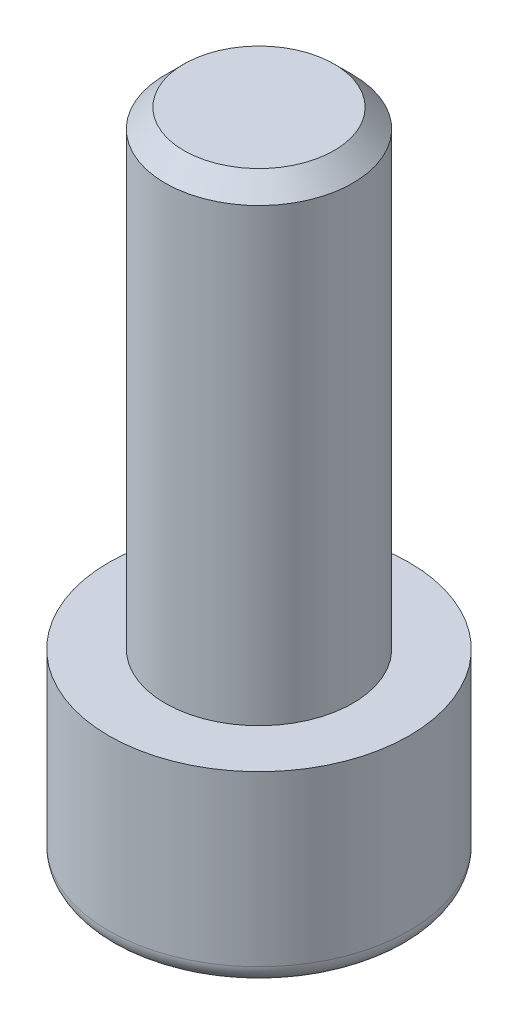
ISO-10303-21;
HEADER;
FILE_DESCRIPTION(('STEP AP214'),'2;1');
FILE_NAME('part.step','',(''),(''),'','','');
FILE_SCHEMA(('AUTOMOTIVE_DESIGN { 1 0 10303 214 1 1 1 1 }'));
ENDSEC;
DATA;
#1=APPLICATION_CONTEXT('core data for automotive mechanical design processes');
#2=APPLICATION_PROTOCOL_DEFINITION('international standard','automotive_design',2000,#1);
#3=PRODUCT_CONTEXT('',#1,'mechanical');
#4=PRODUCT('Part','Part','',(#3));
#5=PRODUCT_RELATED_PRODUCT_CATEGORY('part','',(#4));
#6=PRODUCT_DEFINITION_FORMATION('','',#4);
#7=PRODUCT_DEFINITION_CONTEXT('part definition',#1,'design');
#8=PRODUCT_DEFINITION('design','',#6,#7);
#9=PRODUCT_DEFINITION_SHAPE('','',#8);
#10=(LENGTH_UNIT() NAMED_UNIT(*) SI_UNIT(.MILLI.,.METRE.));
#11=(NAMED_UNIT(*) PLANE_ANGLE_UNIT() SI_UNIT($,.RADIAN.));
#12=(NAMED_UNIT(*) SI_UNIT($,.STERADIAN.) SOLID_ANGLE_UNIT());
#13=UNCERTAINTY_MEASURE_WITH_UNIT(LENGTH_MEASURE(1.E-05),#10,'distance_accuracy_value','');
#14=(GEOMETRIC_REPRESENTATION_CONTEXT(3) GLOBAL_UNCERTAINTY_ASSIGNED_CONTEXT((#13)) GLOBAL_UNIT_ASSIGNED_CONTEXT((#10,
#11,#12)) REPRESENTATION_CONTEXT('',''));
#15=CARTESIAN_POINT('',(0.,0.,0.));
#16=DIRECTION('',(0.,0.,1.));
#17=DIRECTION('',(1.,0.,0.));
#18=AXIS2_PLACEMENT_3D('',#15,#16,#17);
#19=CARTESIAN_POINT('',(0.,25.,0.));
#20=DIRECTION('',(0.,-1.,0.));
#21=DIRECTION('',(0.,0.,-1.));
#22=AXIS2_PLACEMENT_3D('',#19,#20,#21);
#23=CYLINDRICAL_SURFACE('',#22,5.);
#24=CARTESIAN_POINT('',(0.,24.,0.));
#25=DIRECTION('',(0.,1.,0.));
#26=DIRECTION('',(0.,0.,1.));
#27=AXIS2_PLACEMENT_3D('',#24,#25,#26);
#28=CIRCLE('',#27,5.);
#29=CARTESIAN_POINT('',(0.,24.,5.));
#30=VERTEX_POINT('',#29);
#31=EDGE_CURVE('E147',#30,#30,#28,.F.);
#32=ORIENTED_EDGE('',*,*,#31,.T.);
#33=EDGE_LOOP('',(#32));
#34=FACE_BOUND('',#33,.T.);
#35=CARTESIAN_POINT('',(0.,0.,0.));
#36=DIRECTION('',(0.,-1.,0.));
#37=DIRECTION('',(0.,0.,-1.));
#38=AXIS2_PLACEMENT_3D('',#35,#36,#37);
#39=CIRCLE('',#38,5.);
#40=CARTESIAN_POINT('',(0.,0.,-5.));
#41=VERTEX_POINT('',#40);
#42=EDGE_CURVE('E141',#41,#41,#39,.T.);
#43=ORIENTED_EDGE('',*,*,#42,.F.);
#44=EDGE_LOOP('',(#43));
#45=FACE_BOUND('',#44,.T.);
#46=ADVANCED_FACE('F30',(#34,#45),#23,.T.);
#47=CARTESIAN_POINT('',(0.,25.,0.));
#48=DIRECTION('',(0.,1.,0.));
#49=DIRECTION('',(0.,0.,1.));
#50=AXIS2_PLACEMENT_3D('',#47,#48,#49);
#51=PLANE('',#50);
#52=CARTESIAN_POINT('',(0.,25.,0.));
#53=DIRECTION('',(0.,1.,0.));
#54=DIRECTION('',(0.,0.,1.));
#55=AXIS2_PLACEMENT_3D('',#52,#53,#54);
#56=CIRCLE('',#55,4.);
#57=CARTESIAN_POINT('',(0.,25.,4.));
#58=VERTEX_POINT('',#57);
#59=EDGE_CURVE('E144',#58,#58,#56,.T.);
#60=ORIENTED_EDGE('',*,*,#59,.T.);
#61=EDGE_LOOP('',(#60));
#62=FACE_BOUND('',#61,.T.);
#63=ADVANCED_FACE('F168',(#62),#51,.T.);
#64=CARTESIAN_POINT('',(0.,25.,0.));
#65=DIRECTION('',(0.,-1.,0.));
#66=DIRECTION('',(0.,0.,-1.));
#67=AXIS2_PLACEMENT_3D('',#64,#65,#66);
#68=CONICAL_SURFACE('',#67,4.,0.785398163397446);
#69=ORIENTED_EDGE('',*,*,#31,.F.);
#70=EDGE_LOOP('',(#69));
#71=FACE_BOUND('',#70,.T.);
#72=ORIENTED_EDGE('',*,*,#59,.F.);
#73=EDGE_LOOP('',(#72));
#74=FACE_BOUND('',#73,.T.);
#75=ADVANCED_FACE('F173',(#71,#74),#68,.T.);
#76=CARTESIAN_POINT('',(0.,0.,0.));
#77=DIRECTION('',(0.,-1.,0.));
#78=DIRECTION('',(0.,0.,-1.));
#79=AXIS2_PLACEMENT_3D('',#76,#77,#78);
#80=PLANE('',#79);
#81=CARTESIAN_POINT('',(0.,0.,0.));
#82=DIRECTION('',(0.,-1.,0.));
#83=DIRECTION('',(0.,0.,-1.));
#84=AXIS2_PLACEMENT_3D('',#81,#82,#83);
#85=CIRCLE('',#84,8.);
#86=CARTESIAN_POINT('',(0.,0.,-8.));
#87=VERTEX_POINT('',#86);
#88=EDGE_CURVE('E132',#87,#87,#85,.T.);
#89=ORIENTED_EDGE('',*,*,#88,.F.);
#90=EDGE_LOOP('',(#89));
#91=FACE_BOUND('',#90,.T.);
#92=ORIENTED_EDGE('',*,*,#42,.T.);
#93=EDGE_LOOP('',(#92));
#94=FACE_BOUND('',#93,.T.);
#95=ADVANCED_FACE('F179',(#91,#94),#80,.F.);
#96=CARTESIAN_POINT('',(0.,-10.,0.));
#97=DIRECTION('',(0.,1.,0.));
#98=DIRECTION('',(0.,0.,1.));
#99=AXIS2_PLACEMENT_3D('',#96,#97,#98);
#100=CYLINDRICAL_SURFACE('',#99,8.);
#101=CARTESIAN_POINT('',(0.,-9.,0.));
#102=DIRECTION('',(0.,-1.,0.));
#103=DIRECTION('',(0.,0.,-1.));
#104=AXIS2_PLACEMENT_3D('',#101,#102,#103);
#105=CIRCLE('',#104,8.);
#106=CARTESIAN_POINT('',(0.,-9.,-8.));
#107=VERTEX_POINT('',#106);
#108=EDGE_CURVE('E11',#107,#107,#105,.F.);
#109=ORIENTED_EDGE('',*,*,#108,.T.);
#110=EDGE_LOOP('',(#109));
#111=FACE_BOUND('',#110,.T.);
#112=ORIENTED_EDGE('',*,*,#88,.T.);
#113=EDGE_LOOP('',(#112));
#114=FACE_BOUND('',#113,.T.);
#115=ADVANCED_FACE('F163',(#111,#114),#100,.T.);
#116=CARTESIAN_POINT('',(0.,-10.,0.));
#117=DIRECTION('',(0.,-1.,0.));
#118=DIRECTION('',(0.,0.,-1.));
#119=AXIS2_PLACEMENT_3D('',#116,#117,#118);
#120=PLANE('',#119);
#121=DIRECTION('',(-0.867435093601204,0.,0.497550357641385));
#122=VECTOR('',#121,1.);
#123=CARTESIAN_POINT('',(0.,-10.,4.6));
#124=LINE('',#123,#122);
#125=CARTESIAN_POINT('',(4.,-10.,2.30564801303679));
#126=VERTEX_POINT('',#125);
#127=CARTESIAN_POINT('',(0.,-10.,4.6));
#128=VERTEX_POINT('',#127);
#129=EDGE_CURVE('E44',#126,#128,#124,.T.);
#130=ORIENTED_EDGE('',*,*,#129,.F.);
#131=DIRECTION('',(0.,0.,1.));
#132=VECTOR('',#131,1.);
#133=CARTESIAN_POINT('',(4.,-10.,2.30564801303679));
#134=LINE('',#133,#132);
#135=CARTESIAN_POINT('',(4.,-10.,-2.30564801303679));
#136=VERTEX_POINT('',#135);
#137=EDGE_CURVE('E114',#136,#126,#134,.T.);
#138=ORIENTED_EDGE('',*,*,#137,.F.);
#139=DIRECTION('',(0.867435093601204,0.,0.497550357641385));
#140=VECTOR('',#139,1.);
#141=CARTESIAN_POINT('',(4.,-10.,-2.30564801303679));
#142=LINE('',#141,#140);
#143=CARTESIAN_POINT('',(0.,-10.,-4.6));
#144=VERTEX_POINT('',#143);
#145=EDGE_CURVE('E108',#144,#136,#142,.T.);
#146=ORIENTED_EDGE('',*,*,#145,.F.);
#147=DIRECTION('',(0.867435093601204,0.,-0.497550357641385));
#148=VECTOR('',#147,1.);
#149=CARTESIAN_POINT('',(0.,-10.,-4.6));
#150=LINE('',#149,#148);
#151=CARTESIAN_POINT('',(-4.,-10.,-2.30564801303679));
#152=VERTEX_POINT('',#151);
#153=EDGE_CURVE('E106',#152,#144,#150,.T.);
#154=ORIENTED_EDGE('',*,*,#153,.F.);
#155=DIRECTION('',(0.,0.,-1.));
#156=VECTOR('',#155,1.);
#157=CARTESIAN_POINT('',(-4.,-10.,-2.30564801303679));
#158=LINE('',#157,#156);
#159=CARTESIAN_POINT('',(-4.,-10.,2.30564801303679));
#160=VERTEX_POINT('',#159);
#161=EDGE_CURVE('E87',#160,#152,#158,.T.);
#162=ORIENTED_EDGE('',*,*,#161,.F.);
#163=DIRECTION('',(-0.867435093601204,0.,-0.497550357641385));
#164=VECTOR('',#163,1.);
#165=CARTESIAN_POINT('',(-4.,-10.,2.30564801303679));
#166=LINE('',#165,#164);
#167=EDGE_CURVE('E98',#128,#160,#166,.T.);
#168=ORIENTED_EDGE('',*,*,#167,.F.);
#169=EDGE_LOOP('',(#130,#138,#146,#154,#162,#168));
#170=FACE_BOUND('',#169,.T.);
#171=CARTESIAN_POINT('',(0.,-10.,0.));
#172=DIRECTION('',(0.,-1.,0.));
#173=DIRECTION('',(0.,0.,-1.));
#174=AXIS2_PLACEMENT_3D('',#171,#172,#173);
#175=CIRCLE('',#174,7.);
#176=CARTESIAN_POINT('',(0.,-10.,-7.));
#177=VERTEX_POINT('',#176);
#178=EDGE_CURVE('E37',#177,#177,#175,.T.);
#179=ORIENTED_EDGE('',*,*,#178,.T.);
#180=EDGE_LOOP('',(#179));
#181=FACE_BOUND('',#180,.T.);
#182=ADVANCED_FACE('F102',(#170,#181),#120,.T.);
#183=CARTESIAN_POINT('',(0.,-9.,0.));
#184=DIRECTION('',(0.,-1.,0.));
#185=DIRECTION('',(0.,0.,-1.));
#186=AXIS2_PLACEMENT_3D('',#183,#184,#185);
#187=TOROIDAL_SURFACE('',#186,7.,1.);
#188=ORIENTED_EDGE('',*,*,#108,.F.);
#189=EDGE_LOOP('',(#188));
#190=FACE_BOUND('',#189,.T.);
#191=ORIENTED_EDGE('',*,*,#178,.F.);
#192=EDGE_LOOP('',(#191));
#193=FACE_BOUND('',#192,.T.);
#194=ADVANCED_FACE('F152',(#190,#193),#187,.T.);
#195=CARTESIAN_POINT('',(0.,-4.,4.6));
#196=DIRECTION('',(0.497550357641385,0.,0.867435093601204));
#197=DIRECTION('',(0.867435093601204,0.,-0.497550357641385));
#198=AXIS2_PLACEMENT_3D('',#195,#196,#197);
#199=PLANE('',#198);
#200=ORIENTED_EDGE('',*,*,#129,.T.);
#201=DIRECTION('',(0.,-1.,0.));
#202=VECTOR('',#201,1.);
#203=CARTESIAN_POINT('',(0.,-4.,4.6));
#204=LINE('',#203,#202);
#205=CARTESIAN_POINT('',(0.,-4.,4.6));
#206=VERTEX_POINT('',#205);
#207=EDGE_CURVE('E95',#206,#128,#204,.T.);
#208=ORIENTED_EDGE('',*,*,#207,.F.);
#209=DIRECTION('',(-0.867435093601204,0.,0.497550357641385));
#210=VECTOR('',#209,1.);
#211=CARTESIAN_POINT('',(0.,-4.,4.6));
#212=LINE('',#211,#210);
#213=CARTESIAN_POINT('',(4.,-4.,2.30564801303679));
#214=VERTEX_POINT('',#213);
#215=EDGE_CURVE('E116',#214,#206,#212,.T.);
#216=ORIENTED_EDGE('',*,*,#215,.F.);
#217=DIRECTION('',(0.,-1.,0.));
#218=VECTOR('',#217,1.);
#219=CARTESIAN_POINT('',(4.,-4.,2.30564801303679));
#220=LINE('',#219,#218);
#221=EDGE_CURVE('E51',#214,#126,#220,.T.);
#222=ORIENTED_EDGE('',*,*,#221,.T.);
#223=EDGE_LOOP('',(#200,#208,#216,#222));
#224=FACE_BOUND('',#223,.T.);
#225=ADVANCED_FACE('F154',(#224),#199,.F.);
#226=CARTESIAN_POINT('',(4.,-4.,2.30564801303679));
#227=DIRECTION('',(1.,0.,0.));
#228=DIRECTION('',(0.,0.,-1.));
#229=AXIS2_PLACEMENT_3D('',#226,#227,#228);
#230=PLANE('',#229);
#231=ORIENTED_EDGE('',*,*,#137,.T.);
#232=ORIENTED_EDGE('',*,*,#221,.F.);
#233=DIRECTION('',(0.,0.,1.));
#234=VECTOR('',#233,1.);
#235=CARTESIAN_POINT('',(4.,-4.,2.30564801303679));
#236=LINE('',#235,#234);
#237=CARTESIAN_POINT('',(4.,-4.,-2.30564801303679));
#238=VERTEX_POINT('',#237);
#239=EDGE_CURVE('E128',#238,#214,#236,.T.);
#240=ORIENTED_EDGE('',*,*,#239,.F.);
#241=DIRECTION('',(0.,-1.,0.));
#242=VECTOR('',#241,1.);
#243=CARTESIAN_POINT('',(4.,-4.,-2.30564801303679));
#244=LINE('',#243,#242);
#245=EDGE_CURVE('E133',#238,#136,#244,.T.);
#246=ORIENTED_EDGE('',*,*,#245,.T.);
#247=EDGE_LOOP('',(#231,#232,#240,#246));
#248=FACE_BOUND('',#247,.T.);
#249=ADVANCED_FACE('F161',(#248),#230,.F.);
#250=CARTESIAN_POINT('',(4.,-4.,-2.30564801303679));
#251=DIRECTION('',(0.497550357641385,0.,-0.867435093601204));
#252=DIRECTION('',(-0.867435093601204,0.,-0.497550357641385));
#253=AXIS2_PLACEMENT_3D('',#250,#251,#252);
#254=PLANE('',#253);
#255=ORIENTED_EDGE('',*,*,#145,.T.);
#256=ORIENTED_EDGE('',*,*,#245,.F.);
#257=DIRECTION('',(0.867435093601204,0.,0.497550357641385));
#258=VECTOR('',#257,1.);
#259=CARTESIAN_POINT('',(4.,-4.,-2.30564801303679));
#260=LINE('',#259,#258);
#261=CARTESIAN_POINT('',(0.,-4.,-4.6));
#262=VERTEX_POINT('',#261);
#263=EDGE_CURVE('E125',#262,#238,#260,.T.);
#264=ORIENTED_EDGE('',*,*,#263,.F.);
#265=DIRECTION('',(0.,-1.,0.));
#266=VECTOR('',#265,1.);
#267=CARTESIAN_POINT('',(0.,-4.,-4.6));
#268=LINE('',#267,#266);
#269=EDGE_CURVE('E135',#262,#144,#268,.T.);
#270=ORIENTED_EDGE('',*,*,#269,.T.);
#271=EDGE_LOOP('',(#255,#256,#264,#270));
#272=FACE_BOUND('',#271,.T.);
#273=ADVANCED_FACE('F239',(#272),#254,.F.);
#274=CARTESIAN_POINT('',(0.,-4.,-4.6));
#275=DIRECTION('',(-0.497550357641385,0.,-0.867435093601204));
#276=DIRECTION('',(-0.867435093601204,0.,0.497550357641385));
#277=AXIS2_PLACEMENT_3D('',#274,#275,#276);
#278=PLANE('',#277);
#279=ORIENTED_EDGE('',*,*,#153,.T.);
#280=ORIENTED_EDGE('',*,*,#269,.F.);
#281=DIRECTION('',(0.867435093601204,0.,-0.497550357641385));
#282=VECTOR('',#281,1.);
#283=CARTESIAN_POINT('',(0.,-4.,-4.6));
#284=LINE('',#283,#282);
#285=CARTESIAN_POINT('',(-4.,-4.,-2.30564801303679));
#286=VERTEX_POINT('',#285);
#287=EDGE_CURVE('E122',#286,#262,#284,.T.);
#288=ORIENTED_EDGE('',*,*,#287,.F.);
#289=DIRECTION('',(0.,-1.,0.));
#290=VECTOR('',#289,1.);
#291=CARTESIAN_POINT('',(-4.,-4.,-2.30564801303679));
#292=LINE('',#291,#290);
#293=EDGE_CURVE('E94',#286,#152,#292,.T.);
#294=ORIENTED_EDGE('',*,*,#293,.T.);
#295=EDGE_LOOP('',(#279,#280,#288,#294));
#296=FACE_BOUND('',#295,.T.);
#297=ADVANCED_FACE('F247',(#296),#278,.F.);
#298=CARTESIAN_POINT('',(-4.,-4.,-2.30564801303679));
#299=DIRECTION('',(-1.,0.,0.));
#300=DIRECTION('',(0.,0.,1.));
#301=AXIS2_PLACEMENT_3D('',#298,#299,#300);
#302=PLANE('',#301);
#303=ORIENTED_EDGE('',*,*,#161,.T.);
#304=ORIENTED_EDGE('',*,*,#293,.F.);
#305=DIRECTION('',(0.,0.,-1.));
#306=VECTOR('',#305,1.);
#307=CARTESIAN_POINT('',(-4.,-4.,-2.30564801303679));
#308=LINE('',#307,#306);
#309=CARTESIAN_POINT('',(-4.,-4.,2.30564801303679));
#310=VERTEX_POINT('',#309);
#311=EDGE_CURVE('E90',#310,#286,#308,.T.);
#312=ORIENTED_EDGE('',*,*,#311,.F.);
#313=DIRECTION('',(0.,-1.,0.));
#314=VECTOR('',#313,1.);
#315=CARTESIAN_POINT('',(-4.,-4.,2.30564801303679));
#316=LINE('',#315,#314);
#317=EDGE_CURVE('E83',#310,#160,#316,.T.);
#318=ORIENTED_EDGE('',*,*,#317,.T.);
#319=EDGE_LOOP('',(#303,#304,#312,#318));
#320=FACE_BOUND('',#319,.T.);
#321=ADVANCED_FACE('F85',(#320),#302,.F.);
#322=CARTESIAN_POINT('',(-4.,-4.,2.30564801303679));
#323=DIRECTION('',(-0.497550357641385,0.,0.867435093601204));
#324=DIRECTION('',(0.867435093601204,0.,0.497550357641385));
#325=AXIS2_PLACEMENT_3D('',#322,#323,#324);
#326=PLANE('',#325);
#327=ORIENTED_EDGE('',*,*,#167,.T.);
#328=ORIENTED_EDGE('',*,*,#317,.F.);
#329=DIRECTION('',(-0.867435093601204,0.,-0.497550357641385));
#330=VECTOR('',#329,1.);
#331=CARTESIAN_POINT('',(-4.,-4.,2.30564801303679));
#332=LINE('',#331,#330);
#333=EDGE_CURVE('E119',#206,#310,#332,.T.);
#334=ORIENTED_EDGE('',*,*,#333,.F.);
#335=ORIENTED_EDGE('',*,*,#207,.T.);
#336=EDGE_LOOP('',(#327,#328,#334,#335));
#337=FACE_BOUND('',#336,.T.);
#338=ADVANCED_FACE('F99',(#337),#326,.F.);
#339=CARTESIAN_POINT('',(4.,-4.,2.30564801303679));
#340=DIRECTION('',(0.,1.,0.));
#341=DIRECTION('',(0.,0.,1.));
#342=AXIS2_PLACEMENT_3D('',#339,#340,#341);
#343=PLANE('',#342);
#344=ORIENTED_EDGE('',*,*,#215,.T.);
#345=ORIENTED_EDGE('',*,*,#333,.T.);
#346=ORIENTED_EDGE('',*,*,#311,.T.);
#347=ORIENTED_EDGE('',*,*,#287,.T.);
#348=ORIENTED_EDGE('',*,*,#263,.T.);
#349=ORIENTED_EDGE('',*,*,#239,.T.);
#350=EDGE_LOOP('',(#344,#345,#346,#347,#348,#349));
#351=FACE_BOUND('',#350,.T.);
#352=ADVANCED_FACE('F271',(#351),#343,.F.);
#353=CLOSED_SHELL('',(#46,#63,#75,#95,#115,#182,#194,#225,#249,#273,#297,#321,#338,#352));
#354=MANIFOLD_SOLID_BREP('B2',#353);
#355=ADVANCED_BREP_SHAPE_REPRESENTATION('',(#18,#354),#14);
#356=SHAPE_DEFINITION_REPRESENTATION(#9,#355);
ENDSEC;
END-ISO-10303-21;
